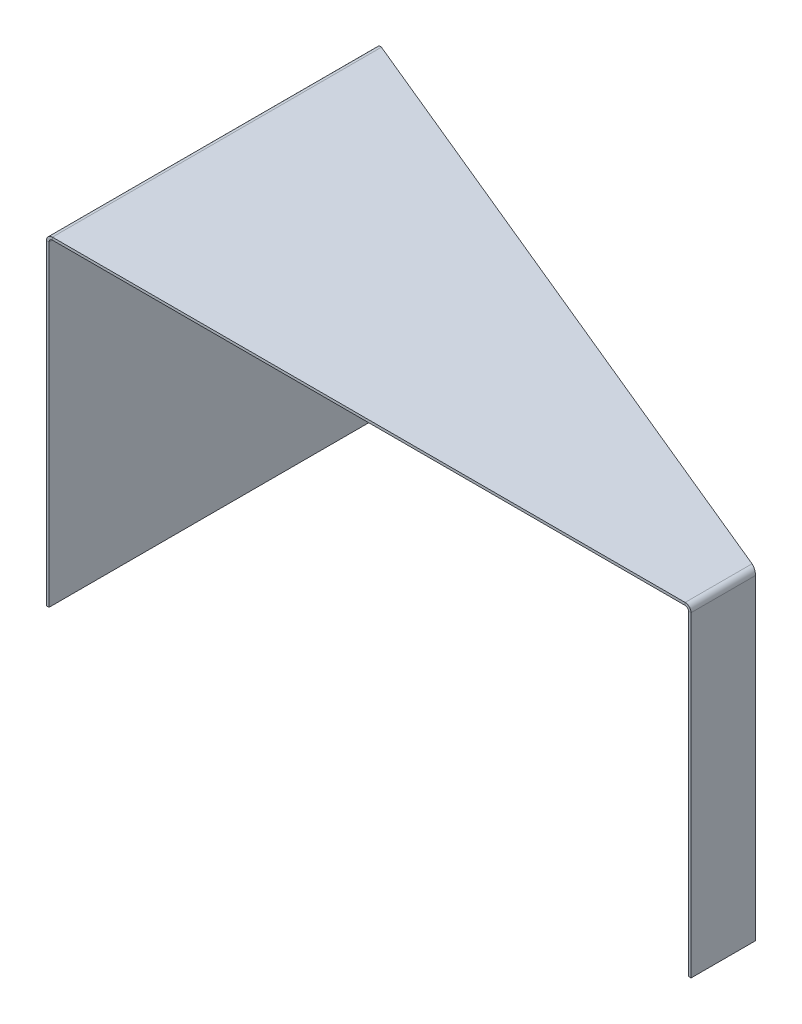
ISO-10303-21;
HEADER;
FILE_DESCRIPTION(('STEP AP214'),'2;1');
FILE_NAME('part.step','',(''),(''),'','','');
FILE_SCHEMA(('AUTOMOTIVE_DESIGN { 1 0 10303 214 1 1 1 1 }'));
ENDSEC;
DATA;
#1=APPLICATION_CONTEXT('core data for automotive mechanical design processes');
#2=APPLICATION_PROTOCOL_DEFINITION('international standard','automotive_design',2000,#1);
#3=PRODUCT_CONTEXT('',#1,'mechanical');
#4=PRODUCT('Part','Part','',(#3));
#5=PRODUCT_RELATED_PRODUCT_CATEGORY('part','',(#4));
#6=PRODUCT_DEFINITION_FORMATION('','',#4);
#7=PRODUCT_DEFINITION_CONTEXT('part definition',#1,'design');
#8=PRODUCT_DEFINITION('design','',#6,#7);
#9=PRODUCT_DEFINITION_SHAPE('','',#8);
#10=(LENGTH_UNIT() NAMED_UNIT(*) SI_UNIT(.MILLI.,.METRE.));
#11=(NAMED_UNIT(*) PLANE_ANGLE_UNIT() SI_UNIT($,.RADIAN.));
#12=(NAMED_UNIT(*) SI_UNIT($,.STERADIAN.) SOLID_ANGLE_UNIT());
#13=UNCERTAINTY_MEASURE_WITH_UNIT(LENGTH_MEASURE(1.E-05),#10,'distance_accuracy_value','');
#14=(GEOMETRIC_REPRESENTATION_CONTEXT(3) GLOBAL_UNCERTAINTY_ASSIGNED_CONTEXT((#13)) GLOBAL_UNIT_ASSIGNED_CONTEXT((#10,
#11,#12)) REPRESENTATION_CONTEXT('',''));
#15=CARTESIAN_POINT('',(0.,0.,0.));
#16=DIRECTION('',(0.,0.,1.));
#17=DIRECTION('',(1.,0.,0.));
#18=AXIS2_PLACEMENT_3D('',#15,#16,#17);
#19=CARTESIAN_POINT('',(498.,250.,300.));
#20=DIRECTION('',(1.,0.,0.));
#21=DIRECTION('',(0.,1.,0.));
#22=AXIS2_PLACEMENT_3D('',#19,#20,#21);
#23=PLANE('',#22);
#24=DIRECTION('',(0.,1.,0.));
#25=VECTOR('',#24,1.);
#26=CARTESIAN_POINT('',(498.,250.,250.));
#27=LINE('',#26,#25);
#28=CARTESIAN_POINT('',(498.,245.4,250.));
#29=VERTEX_POINT('',#28);
#30=CARTESIAN_POINT('',(498.,0.,250.));
#31=VERTEX_POINT('',#30);
#32=EDGE_CURVE('E259',#29,#31,#27,.F.);
#33=ORIENTED_EDGE('',*,*,#32,.T.);
#34=DIRECTION('',(0.,0.,-1.));
#35=VECTOR('',#34,1.);
#36=CARTESIAN_POINT('',(498.,0.,300.));
#37=LINE('',#36,#35);
#38=CARTESIAN_POINT('',(498.,0.,300.));
#39=VERTEX_POINT('',#38);
#40=EDGE_CURVE('E186',#39,#31,#37,.T.);
#41=ORIENTED_EDGE('',*,*,#40,.F.);
#42=DIRECTION('',(0.,-1.,0.));
#43=VECTOR('',#42,1.);
#44=CARTESIAN_POINT('',(498.,250.,300.));
#45=LINE('',#44,#43);
#46=CARTESIAN_POINT('',(498.,245.4,300.));
#47=VERTEX_POINT('',#46);
#48=EDGE_CURVE('E141',#47,#39,#45,.T.);
#49=ORIENTED_EDGE('',*,*,#48,.F.);
#50=DIRECTION('',(0.,0.,-1.));
#51=VECTOR('',#50,1.);
#52=CARTESIAN_POINT('',(498.,245.4,300.));
#53=LINE('',#52,#51);
#54=EDGE_CURVE('E156',#47,#29,#53,.T.);
#55=ORIENTED_EDGE('',*,*,#54,.T.);
#56=EDGE_LOOP('',(#33,#41,#49,#55));
#57=FACE_BOUND('',#56,.T.);
#58=ADVANCED_FACE('F34',(#57),#23,.F.);
#59=CARTESIAN_POINT('',(500.,0.,300.));
#60=DIRECTION('',(0.,-1.,0.));
#61=DIRECTION('',(1.,0.,0.));
#62=AXIS2_PLACEMENT_3D('',#59,#60,#61);
#63=PLANE('',#62);
#64=ORIENTED_EDGE('',*,*,#40,.T.);
#65=DIRECTION('',(1.,0.,0.));
#66=VECTOR('',#65,1.);
#67=CARTESIAN_POINT('',(500.,0.,250.));
#68=LINE('',#67,#66);
#69=CARTESIAN_POINT('',(500.,0.,250.));
#70=VERTEX_POINT('',#69);
#71=EDGE_CURVE('E262',#70,#31,#68,.F.);
#72=ORIENTED_EDGE('',*,*,#71,.F.);
#73=DIRECTION('',(0.,0.,-1.));
#74=VECTOR('',#73,1.);
#75=CARTESIAN_POINT('',(500.,0.,300.));
#76=LINE('',#75,#74);
#77=CARTESIAN_POINT('',(500.,0.,300.));
#78=VERTEX_POINT('',#77);
#79=EDGE_CURVE('E183',#78,#70,#76,.T.);
#80=ORIENTED_EDGE('',*,*,#79,.F.);
#81=DIRECTION('',(-1.,0.,0.));
#82=VECTOR('',#81,1.);
#83=CARTESIAN_POINT('',(500.,0.,300.));
#84=LINE('',#83,#82);
#85=EDGE_CURVE('E238',#78,#39,#84,.T.);
#86=ORIENTED_EDGE('',*,*,#85,.T.);
#87=EDGE_LOOP('',(#64,#72,#80,#86));
#88=FACE_BOUND('',#87,.T.);
#89=ADVANCED_FACE('F305',(#88),#63,.T.);
#90=CARTESIAN_POINT('',(500.,250.,300.));
#91=DIRECTION('',(1.,0.,0.));
#92=DIRECTION('',(0.,1.,0.));
#93=AXIS2_PLACEMENT_3D('',#90,#91,#92);
#94=PLANE('',#93);
#95=ORIENTED_EDGE('',*,*,#79,.T.);
#96=DIRECTION('',(0.,-1.,0.));
#97=VECTOR('',#96,1.);
#98=CARTESIAN_POINT('',(500.,1043.03609627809,250.));
#99=LINE('',#98,#97);
#100=CARTESIAN_POINT('',(500.,245.4,250.));
#101=VERTEX_POINT('',#100);
#102=EDGE_CURVE('E130',#101,#70,#99,.T.);
#103=ORIENTED_EDGE('',*,*,#102,.F.);
#104=DIRECTION('',(0.,0.,-1.));
#105=VECTOR('',#104,1.);
#106=CARTESIAN_POINT('',(500.,245.4,300.));
#107=LINE('',#106,#105);
#108=CARTESIAN_POINT('',(500.,245.4,300.));
#109=VERTEX_POINT('',#108);
#110=EDGE_CURVE('E180',#109,#101,#107,.T.);
#111=ORIENTED_EDGE('',*,*,#110,.F.);
#112=DIRECTION('',(0.,-1.,0.));
#113=VECTOR('',#112,1.);
#114=CARTESIAN_POINT('',(500.,250.,300.));
#115=LINE('',#114,#113);
#116=EDGE_CURVE('E240',#109,#78,#115,.T.);
#117=ORIENTED_EDGE('',*,*,#116,.T.);
#118=EDGE_LOOP('',(#95,#103,#111,#117));
#119=FACE_BOUND('',#118,.T.);
#120=ADVANCED_FACE('F310',(#119),#94,.T.);
#121=CARTESIAN_POINT('',(495.4,245.4,300.));
#122=DIRECTION('',(0.,0.,-1.));
#123=DIRECTION('',(-1.,0.,0.));
#124=AXIS2_PLACEMENT_3D('',#121,#122,#123);
#125=CYLINDRICAL_SURFACE('',#124,4.6);
#126=ORIENTED_EDGE('',*,*,#110,.T.);
#127=CARTESIAN_POINT('',(495.4,245.4,248.094617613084));
#128=DIRECTION('',(-0.382683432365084,0.,0.923879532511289));
#129=DIRECTION('',(-0.923879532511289,0.,-0.382683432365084));
#130=AXIS2_PLACEMENT_3D('',#127,#128,#129);
#131=ELLIPSE('',#130,4.979004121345,4.6);
#132=CARTESIAN_POINT('',(495.4,250.,248.094617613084));
#133=VERTEX_POINT('',#132);
#134=EDGE_CURVE('E131',#133,#101,#131,.F.);
#135=ORIENTED_EDGE('',*,*,#134,.F.);
#136=DIRECTION('',(0.,0.,-1.));
#137=VECTOR('',#136,1.);
#138=CARTESIAN_POINT('',(495.4,250.,300.));
#139=LINE('',#138,#137);
#140=CARTESIAN_POINT('',(495.4,250.,300.));
#141=VERTEX_POINT('',#140);
#142=EDGE_CURVE('E177',#141,#133,#139,.T.);
#143=ORIENTED_EDGE('',*,*,#142,.F.);
#144=CARTESIAN_POINT('',(495.4,245.4,300.));
#145=DIRECTION('',(0.,0.,1.));
#146=DIRECTION('',(1.,0.,0.));
#147=AXIS2_PLACEMENT_3D('',#144,#145,#146);
#148=CIRCLE('',#147,4.6);
#149=EDGE_CURVE('E246',#141,#109,#148,.F.);
#150=ORIENTED_EDGE('',*,*,#149,.T.);
#151=EDGE_LOOP('',(#126,#135,#143,#150));
#152=FACE_BOUND('',#151,.T.);
#153=ADVANCED_FACE('F256',(#152),#125,.T.);
#154=CARTESIAN_POINT('',(0.,250.,300.));
#155=DIRECTION('',(0.,1.,0.));
#156=DIRECTION('',(0.,0.,1.));
#157=AXIS2_PLACEMENT_3D('',#154,#155,#156);
#158=PLANE('',#157);
#159=ORIENTED_EDGE('',*,*,#142,.T.);
#160=DIRECTION('',(0.923879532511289,0.,0.382683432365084));
#161=VECTOR('',#160,1.);
#162=CARTESIAN_POINT('',(90.9009742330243,250.,80.5456351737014));
#163=LINE('',#162,#161);
#164=CARTESIAN_POINT('',(4.6,250.,44.7986012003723));
#165=VERTEX_POINT('',#164);
#166=EDGE_CURVE('E140',#165,#133,#163,.T.);
#167=ORIENTED_EDGE('',*,*,#166,.F.);
#168=DIRECTION('',(0.,0.,-1.));
#169=VECTOR('',#168,1.);
#170=CARTESIAN_POINT('',(4.6,250.,300.));
#171=LINE('',#170,#169);
#172=CARTESIAN_POINT('',(4.6,250.,300.));
#173=VERTEX_POINT('',#172);
#174=EDGE_CURVE('E174',#173,#165,#171,.T.);
#175=ORIENTED_EDGE('',*,*,#174,.F.);
#176=DIRECTION('',(1.,0.,0.));
#177=VECTOR('',#176,1.);
#178=CARTESIAN_POINT('',(0.,250.,300.));
#179=LINE('',#178,#177);
#180=EDGE_CURVE('E215',#173,#141,#179,.T.);
#181=ORIENTED_EDGE('',*,*,#180,.T.);
#182=EDGE_LOOP('',(#159,#167,#175,#181));
#183=FACE_BOUND('',#182,.T.);
#184=ADVANCED_FACE('F251',(#183),#158,.T.);
#185=CARTESIAN_POINT('',(4.6,245.4,300.));
#186=DIRECTION('',(0.,0.,-1.));
#187=DIRECTION('',(-1.,0.,0.));
#188=AXIS2_PLACEMENT_3D('',#185,#186,#187);
#189=CYLINDRICAL_SURFACE('',#188,4.6);
#190=ORIENTED_EDGE('',*,*,#174,.T.);
#191=CARTESIAN_POINT('',(4.6,245.4,44.7986012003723));
#192=DIRECTION('',(-0.227956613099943,0.,0.973671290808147));
#193=DIRECTION('',(-0.973671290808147,0.,-0.227956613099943));
#194=AXIS2_PLACEMENT_3D('',#191,#192,#193);
#195=ELLIPSE('',#194,4.72438701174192,4.6);
#196=CARTESIAN_POINT('',(0.,245.4,43.7216459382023));
#197=VERTEX_POINT('',#196);
#198=EDGE_CURVE('E211',#197,#165,#195,.F.);
#199=ORIENTED_EDGE('',*,*,#198,.F.);
#200=DIRECTION('',(0.,0.,-1.));
#201=VECTOR('',#200,1.);
#202=CARTESIAN_POINT('',(0.,245.4,300.));
#203=LINE('',#202,#201);
#204=CARTESIAN_POINT('',(0.,245.4,300.));
#205=VERTEX_POINT('',#204);
#206=EDGE_CURVE('E171',#205,#197,#203,.T.);
#207=ORIENTED_EDGE('',*,*,#206,.F.);
#208=CARTESIAN_POINT('',(4.6,245.4,300.));
#209=DIRECTION('',(0.,0.,1.));
#210=DIRECTION('',(1.,0.,0.));
#211=AXIS2_PLACEMENT_3D('',#208,#209,#210);
#212=CIRCLE('',#211,4.6);
#213=EDGE_CURVE('E210',#205,#173,#212,.F.);
#214=ORIENTED_EDGE('',*,*,#213,.T.);
#215=EDGE_LOOP('',(#190,#199,#207,#214));
#216=FACE_BOUND('',#215,.T.);
#217=ADVANCED_FACE('F209',(#216),#189,.T.);
#218=CARTESIAN_POINT('',(0.,0.,300.));
#219=DIRECTION('',(-1.,0.,0.));
#220=DIRECTION('',(0.,0.,1.));
#221=AXIS2_PLACEMENT_3D('',#218,#219,#220);
#222=PLANE('',#221);
#223=ORIENTED_EDGE('',*,*,#206,.T.);
#224=DIRECTION('',(0.,1.,0.));
#225=VECTOR('',#224,1.);
#226=CARTESIAN_POINT('',(0.,0.,43.7216459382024));
#227=LINE('',#226,#225);
#228=CARTESIAN_POINT('',(0.,0.,43.7216459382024));
#229=VERTEX_POINT('',#228);
#230=EDGE_CURVE('E270',#229,#197,#227,.T.);
#231=ORIENTED_EDGE('',*,*,#230,.F.);
#232=DIRECTION('',(0.,0.,-1.));
#233=VECTOR('',#232,1.);
#234=CARTESIAN_POINT('',(0.,0.,300.));
#235=LINE('',#234,#233);
#236=CARTESIAN_POINT('',(0.,0.,300.));
#237=VERTEX_POINT('',#236);
#238=EDGE_CURVE('E168',#237,#229,#235,.T.);
#239=ORIENTED_EDGE('',*,*,#238,.F.);
#240=DIRECTION('',(0.,1.,0.));
#241=VECTOR('',#240,1.);
#242=CARTESIAN_POINT('',(0.,0.,300.));
#243=LINE('',#242,#241);
#244=EDGE_CURVE('E198',#237,#205,#243,.T.);
#245=ORIENTED_EDGE('',*,*,#244,.T.);
#246=EDGE_LOOP('',(#223,#231,#239,#245));
#247=FACE_BOUND('',#246,.T.);
#248=ADVANCED_FACE('F217',(#247),#222,.T.);
#249=CARTESIAN_POINT('',(2.,0.,300.));
#250=DIRECTION('',(0.,-1.,0.));
#251=DIRECTION('',(0.,0.,-1.));
#252=AXIS2_PLACEMENT_3D('',#249,#250,#251);
#253=PLANE('',#252);
#254=ORIENTED_EDGE('',*,*,#238,.T.);
#255=DIRECTION('',(1.,0.,0.));
#256=VECTOR('',#255,1.);
#257=CARTESIAN_POINT('',(2.,0.,43.7216459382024));
#258=LINE('',#257,#256);
#259=CARTESIAN_POINT('',(2.,0.,43.7216459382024));
#260=VERTEX_POINT('',#259);
#261=EDGE_CURVE('E272',#260,#229,#258,.F.);
#262=ORIENTED_EDGE('',*,*,#261,.F.);
#263=DIRECTION('',(0.,0.,-1.));
#264=VECTOR('',#263,1.);
#265=CARTESIAN_POINT('',(2.,0.,300.));
#266=LINE('',#265,#264);
#267=CARTESIAN_POINT('',(2.,0.,300.));
#268=VERTEX_POINT('',#267);
#269=EDGE_CURVE('E165',#268,#260,#266,.T.);
#270=ORIENTED_EDGE('',*,*,#269,.F.);
#271=DIRECTION('',(-1.,0.,0.));
#272=VECTOR('',#271,1.);
#273=CARTESIAN_POINT('',(2.,0.,300.));
#274=LINE('',#273,#272);
#275=EDGE_CURVE('E218',#268,#237,#274,.T.);
#276=ORIENTED_EDGE('',*,*,#275,.T.);
#277=EDGE_LOOP('',(#254,#262,#270,#276));
#278=FACE_BOUND('',#277,.T.);
#279=ADVANCED_FACE('F284',(#278),#253,.T.);
#280=CARTESIAN_POINT('',(2.,0.,300.));
#281=DIRECTION('',(-1.,0.,0.));
#282=DIRECTION('',(0.,0.,1.));
#283=AXIS2_PLACEMENT_3D('',#280,#281,#282);
#284=PLANE('',#283);
#285=DIRECTION('',(0.,1.,0.));
#286=VECTOR('',#285,1.);
#287=CARTESIAN_POINT('',(2.,0.,43.7216459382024));
#288=LINE('',#287,#286);
#289=CARTESIAN_POINT('',(2.,245.4,43.7216459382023));
#290=VERTEX_POINT('',#289);
#291=EDGE_CURVE('E267',#260,#290,#288,.T.);
#292=ORIENTED_EDGE('',*,*,#291,.T.);
#293=DIRECTION('',(0.,0.,-1.));
#294=VECTOR('',#293,1.);
#295=CARTESIAN_POINT('',(2.,245.4,300.));
#296=LINE('',#295,#294);
#297=CARTESIAN_POINT('',(2.,245.4,300.));
#298=VERTEX_POINT('',#297);
#299=EDGE_CURVE('E158',#298,#290,#296,.T.);
#300=ORIENTED_EDGE('',*,*,#299,.F.);
#301=DIRECTION('',(0.,1.,0.));
#302=VECTOR('',#301,1.);
#303=CARTESIAN_POINT('',(2.,0.,300.));
#304=LINE('',#303,#302);
#305=EDGE_CURVE('E201',#268,#298,#304,.T.);
#306=ORIENTED_EDGE('',*,*,#305,.F.);
#307=ORIENTED_EDGE('',*,*,#269,.T.);
#308=EDGE_LOOP('',(#292,#300,#306,#307));
#309=FACE_BOUND('',#308,.T.);
#310=ADVANCED_FACE('F286',(#309),#284,.F.);
#311=CARTESIAN_POINT('',(4.6,245.4,300.));
#312=DIRECTION('',(0.,0.,-1.));
#313=DIRECTION('',(-1.,0.,0.));
#314=AXIS2_PLACEMENT_3D('',#311,#312,#313);
#315=CYLINDRICAL_SURFACE('',#314,2.6);
#316=CARTESIAN_POINT('',(4.6,245.4,44.7986012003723));
#317=DIRECTION('',(-0.382683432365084,0.,0.923879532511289));
#318=DIRECTION('',(-0.923879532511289,0.,-0.382683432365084));
#319=AXIS2_PLACEMENT_3D('',#316,#317,#318);
#320=ELLIPSE('',#319,2.81421972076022,2.6);
#321=CARTESIAN_POINT('',(4.6,248.,44.7986012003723));
#322=VERTEX_POINT('',#321);
#323=EDGE_CURVE('E264',#290,#322,#320,.F.);
#324=ORIENTED_EDGE('',*,*,#323,.T.);
#325=DIRECTION('',(0.,0.,-1.));
#326=VECTOR('',#325,1.);
#327=CARTESIAN_POINT('',(4.6,248.,300.));
#328=LINE('',#327,#326);
#329=CARTESIAN_POINT('',(4.6,248.,300.));
#330=VERTEX_POINT('',#329);
#331=EDGE_CURVE('E152',#330,#322,#328,.T.);
#332=ORIENTED_EDGE('',*,*,#331,.F.);
#333=CARTESIAN_POINT('',(4.6,245.4,300.));
#334=DIRECTION('',(0.,0.,1.));
#335=DIRECTION('',(1.,0.,0.));
#336=AXIS2_PLACEMENT_3D('',#333,#334,#335);
#337=CIRCLE('',#336,2.6);
#338=EDGE_CURVE('E224',#298,#330,#337,.F.);
#339=ORIENTED_EDGE('',*,*,#338,.F.);
#340=ORIENTED_EDGE('',*,*,#299,.T.);
#341=EDGE_LOOP('',(#324,#332,#339,#340));
#342=FACE_BOUND('',#341,.T.);
#343=ADVANCED_FACE('F289',(#342),#315,.F.);
#344=CARTESIAN_POINT('',(0.,248.,300.));
#345=DIRECTION('',(0.,1.,0.));
#346=DIRECTION('',(0.,0.,1.));
#347=AXIS2_PLACEMENT_3D('',#344,#345,#346);
#348=PLANE('',#347);
#349=DIRECTION('',(0.923879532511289,0.,0.382683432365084));
#350=VECTOR('',#349,1.);
#351=CARTESIAN_POINT('',(90.9009742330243,248.,80.5456351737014));
#352=LINE('',#351,#350);
#353=CARTESIAN_POINT('',(495.4,248.,248.094617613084));
#354=VERTEX_POINT('',#353);
#355=EDGE_CURVE('E137',#322,#354,#352,.T.);
#356=ORIENTED_EDGE('',*,*,#355,.T.);
#357=DIRECTION('',(0.,0.,-1.));
#358=VECTOR('',#357,1.);
#359=CARTESIAN_POINT('',(495.4,248.,300.));
#360=LINE('',#359,#358);
#361=CARTESIAN_POINT('',(495.4,248.,300.));
#362=VERTEX_POINT('',#361);
#363=EDGE_CURVE('E149',#362,#354,#360,.T.);
#364=ORIENTED_EDGE('',*,*,#363,.F.);
#365=DIRECTION('',(1.,0.,0.));
#366=VECTOR('',#365,1.);
#367=CARTESIAN_POINT('',(0.,248.,300.));
#368=LINE('',#367,#366);
#369=EDGE_CURVE('E226',#330,#362,#368,.T.);
#370=ORIENTED_EDGE('',*,*,#369,.F.);
#371=ORIENTED_EDGE('',*,*,#331,.T.);
#372=EDGE_LOOP('',(#356,#364,#370,#371));
#373=FACE_BOUND('',#372,.T.);
#374=ADVANCED_FACE('F147',(#373),#348,.F.);
#375=CARTESIAN_POINT('',(495.4,245.4,300.));
#376=DIRECTION('',(0.,0.,-1.));
#377=DIRECTION('',(-1.,0.,0.));
#378=AXIS2_PLACEMENT_3D('',#375,#376,#377);
#379=CYLINDRICAL_SURFACE('',#378,2.6);
#380=CARTESIAN_POINT('',(495.4,245.4,248.094617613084));
#381=DIRECTION('',(-0.59110454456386,0.,0.806594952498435));
#382=DIRECTION('',(-0.806594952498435,0.,-0.59110454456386));
#383=AXIS2_PLACEMENT_3D('',#380,#381,#382);
#384=ELLIPSE('',#383,3.22342706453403,2.6);
#385=EDGE_CURVE('E121',#354,#29,#384,.F.);
#386=ORIENTED_EDGE('',*,*,#385,.T.);
#387=ORIENTED_EDGE('',*,*,#54,.F.);
#388=CARTESIAN_POINT('',(495.4,245.4,300.));
#389=DIRECTION('',(0.,0.,1.));
#390=DIRECTION('',(1.,0.,0.));
#391=AXIS2_PLACEMENT_3D('',#388,#389,#390);
#392=CIRCLE('',#391,2.6);
#393=EDGE_CURVE('E155',#362,#47,#392,.F.);
#394=ORIENTED_EDGE('',*,*,#393,.F.);
#395=ORIENTED_EDGE('',*,*,#363,.T.);
#396=EDGE_LOOP('',(#386,#387,#394,#395));
#397=FACE_BOUND('',#396,.T.);
#398=ADVANCED_FACE('F154',(#397),#379,.F.);
#399=CARTESIAN_POINT('',(4.6,250.,300.));
#400=DIRECTION('',(0.,0.,1.));
#401=DIRECTION('',(1.,0.,0.));
#402=AXIS2_PLACEMENT_3D('',#399,#400,#401);
#403=PLANE('',#402);
#404=DIRECTION('',(0.,-1.,0.));
#405=VECTOR('',#404,1.);
#406=CARTESIAN_POINT('',(4.6,250.,300.));
#407=LINE('',#406,#405);
#408=EDGE_CURVE('E11',#173,#330,#407,.T.);
#409=ORIENTED_EDGE('',*,*,#408,.F.);
#410=ORIENTED_EDGE('',*,*,#213,.F.);
#411=DIRECTION('',(-1.,0.,0.));
#412=VECTOR('',#411,1.);
#413=CARTESIAN_POINT('',(2.,245.4,300.));
#414=LINE('',#413,#412);
#415=EDGE_CURVE('E42',#298,#205,#414,.T.);
#416=ORIENTED_EDGE('',*,*,#415,.F.);
#417=ORIENTED_EDGE('',*,*,#338,.T.);
#418=EDGE_LOOP('',(#409,#410,#416,#417));
#419=FACE_BOUND('',#418,.T.);
#420=ADVANCED_FACE('F36',(#419),#403,.T.);
#421=CARTESIAN_POINT('',(2.,245.4,300.));
#422=DIRECTION('',(0.,0.,1.));
#423=DIRECTION('',(1.,0.,0.));
#424=AXIS2_PLACEMENT_3D('',#421,#422,#423);
#425=PLANE('',#424);
#426=ORIENTED_EDGE('',*,*,#180,.F.);
#427=ORIENTED_EDGE('',*,*,#408,.T.);
#428=ORIENTED_EDGE('',*,*,#369,.T.);
#429=DIRECTION('',(0.,1.,0.));
#430=VECTOR('',#429,1.);
#431=CARTESIAN_POINT('',(495.4,248.,300.));
#432=LINE('',#431,#430);
#433=EDGE_CURVE('E189',#362,#141,#432,.T.);
#434=ORIENTED_EDGE('',*,*,#433,.T.);
#435=EDGE_LOOP('',(#426,#427,#428,#434));
#436=FACE_BOUND('',#435,.T.);
#437=ADVANCED_FACE('F254',(#436),#425,.T.);
#438=CARTESIAN_POINT('',(500.,245.4,300.));
#439=DIRECTION('',(0.,0.,1.));
#440=DIRECTION('',(1.,0.,0.));
#441=AXIS2_PLACEMENT_3D('',#438,#439,#440);
#442=PLANE('',#441);
#443=DIRECTION('',(-1.,0.,0.));
#444=VECTOR('',#443,1.);
#445=CARTESIAN_POINT('',(500.,245.4,300.));
#446=LINE('',#445,#444);
#447=EDGE_CURVE('E57',#109,#47,#446,.T.);
#448=ORIENTED_EDGE('',*,*,#447,.F.);
#449=ORIENTED_EDGE('',*,*,#149,.F.);
#450=ORIENTED_EDGE('',*,*,#433,.F.);
#451=ORIENTED_EDGE('',*,*,#393,.T.);
#452=EDGE_LOOP('',(#448,#449,#450,#451));
#453=FACE_BOUND('',#452,.T.);
#454=ADVANCED_FACE('F229',(#453),#442,.T.);
#455=CARTESIAN_POINT('',(495.4,248.,300.));
#456=DIRECTION('',(0.,0.,1.));
#457=DIRECTION('',(1.,0.,0.));
#458=AXIS2_PLACEMENT_3D('',#455,#456,#457);
#459=PLANE('',#458);
#460=ORIENTED_EDGE('',*,*,#116,.F.);
#461=ORIENTED_EDGE('',*,*,#447,.T.);
#462=ORIENTED_EDGE('',*,*,#48,.T.);
#463=ORIENTED_EDGE('',*,*,#85,.F.);
#464=EDGE_LOOP('',(#460,#461,#462,#463));
#465=FACE_BOUND('',#464,.T.);
#466=ADVANCED_FACE('F315',(#465),#459,.T.);
#467=CARTESIAN_POINT('',(495.4,245.4,300.));
#468=DIRECTION('',(0.,0.,1.));
#469=DIRECTION('',(1.,0.,0.));
#470=AXIS2_PLACEMENT_3D('',#467,#468,#469);
#471=PLANE('',#470);
#472=ORIENTED_EDGE('',*,*,#305,.T.);
#473=ORIENTED_EDGE('',*,*,#415,.T.);
#474=ORIENTED_EDGE('',*,*,#244,.F.);
#475=ORIENTED_EDGE('',*,*,#275,.F.);
#476=EDGE_LOOP('',(#472,#473,#474,#475));
#477=FACE_BOUND('',#476,.T.);
#478=ADVANCED_FACE('F195',(#477),#471,.T.);
#479=CARTESIAN_POINT('',(90.9009742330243,250.,80.5456351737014));
#480=DIRECTION('',(-0.382683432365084,0.,0.923879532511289));
#481=DIRECTION('',(0.923879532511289,0.,0.382683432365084));
#482=AXIS2_PLACEMENT_3D('',#479,#480,#481);
#483=PLANE('',#482);
#484=ORIENTED_EDGE('',*,*,#166,.T.);
#485=DIRECTION('',(0.,1.,0.));
#486=VECTOR('',#485,1.);
#487=CARTESIAN_POINT('',(495.4,250.,248.094617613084));
#488=LINE('',#487,#486);
#489=EDGE_CURVE('E124',#133,#354,#488,.F.);
#490=ORIENTED_EDGE('',*,*,#489,.T.);
#491=ORIENTED_EDGE('',*,*,#355,.F.);
#492=DIRECTION('',(0.,1.,0.));
#493=VECTOR('',#492,1.);
#494=CARTESIAN_POINT('',(4.6,250.,44.7986012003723));
#495=LINE('',#494,#493);
#496=EDGE_CURVE('E142',#165,#322,#495,.F.);
#497=ORIENTED_EDGE('',*,*,#496,.F.);
#498=EDGE_LOOP('',(#484,#490,#491,#497));
#499=FACE_BOUND('',#498,.T.);
#500=ADVANCED_FACE('F135',(#499),#483,.F.);
#501=CARTESIAN_POINT('',(2.,0.,43.7216459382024));
#502=DIRECTION('',(0.,0.,1.));
#503=DIRECTION('',(0.,1.,0.));
#504=AXIS2_PLACEMENT_3D('',#501,#502,#503);
#505=PLANE('',#504);
#506=DIRECTION('',(1.,0.,0.));
#507=VECTOR('',#506,1.);
#508=CARTESIAN_POINT('',(2.,245.4,43.7216459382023));
#509=LINE('',#508,#507);
#510=EDGE_CURVE('E275',#290,#197,#509,.F.);
#511=ORIENTED_EDGE('',*,*,#510,.F.);
#512=ORIENTED_EDGE('',*,*,#291,.F.);
#513=ORIENTED_EDGE('',*,*,#261,.T.);
#514=ORIENTED_EDGE('',*,*,#230,.T.);
#515=EDGE_LOOP('',(#511,#512,#513,#514));
#516=FACE_BOUND('',#515,.T.);
#517=ADVANCED_FACE('F282',(#516),#505,.F.);
#518=CARTESIAN_POINT('',(0.,245.4,43.7216459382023));
#519=CARTESIAN_POINT('',(0.666666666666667,245.4,43.7216459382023));
#520=CARTESIAN_POINT('',(1.33333333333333,245.4,43.7216459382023));
#521=CARTESIAN_POINT('',(2.,245.4,43.7216459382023));
#522=CARTESIAN_POINT('',(0.,254.6,43.7216459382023));
#523=CARTESIAN_POINT('',(0.666666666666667,253.266666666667,43.7216459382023));
#524=CARTESIAN_POINT('',(1.33333333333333,251.933333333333,43.7216459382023));
#525=CARTESIAN_POINT('',(2.,250.6,43.7216459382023));
#526=CARTESIAN_POINT('',(9.2,254.6,45.8755564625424));
#527=CARTESIAN_POINT('',(8.53333333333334,253.266666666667,45.8755564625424));
#528=CARTESIAN_POINT('',(7.86666666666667,251.933333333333,45.8755564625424));
#529=CARTESIAN_POINT('',(7.2,250.6,45.8755564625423));
#530=CARTESIAN_POINT('',(9.2,245.4,45.8755564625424));
#531=CARTESIAN_POINT('',(8.53333333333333,245.4,45.8755564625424));
#532=CARTESIAN_POINT('',(7.86666666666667,245.4,45.8755564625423));
#533=CARTESIAN_POINT('',(7.2,245.4,45.8755564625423));
#534=CARTESIAN_POINT('',(9.2,236.2,45.8755564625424));
#535=CARTESIAN_POINT('',(8.53333333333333,237.533333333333,45.8755564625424));
#536=CARTESIAN_POINT('',(7.86666666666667,238.866666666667,45.8755564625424));
#537=CARTESIAN_POINT('',(7.2,240.2,45.8755564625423));
#538=CARTESIAN_POINT('',(0.,236.2,43.7216459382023));
#539=CARTESIAN_POINT('',(0.666666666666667,237.533333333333,43.7216459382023));
#540=CARTESIAN_POINT('',(1.33333333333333,238.866666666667,43.7216459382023));
#541=CARTESIAN_POINT('',(2.,240.2,43.7216459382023));
#542=CARTESIAN_POINT('',(0.,245.4,43.7216459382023));
#543=CARTESIAN_POINT('',(0.666666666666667,245.4,43.7216459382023));
#544=CARTESIAN_POINT('',(1.33333333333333,245.4,43.7216459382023));
#545=CARTESIAN_POINT('',(2.,245.4,43.7216459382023));
#546=(BOUNDED_SURFACE() B_SPLINE_SURFACE(3,3,((#518,#519,#520,#521),(#522,#523,#524,#525),(#526,
#527,#528,#529),(#530,#531,#532,#533),(#534,#535,#536,#537),(#538,#539,#540,#541),(#542,#543,
#544,#545)),.UNSPECIFIED.,.T.,.F.,.F.) B_SPLINE_SURFACE_WITH_KNOTS((4,3,4),(4,4),(0.,0.5,1.),
(0.,1.),.UNSPECIFIED.) GEOMETRIC_REPRESENTATION_ITEM() RATIONAL_B_SPLINE_SURFACE(((1.,1.,1.,1.),
(0.333333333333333,0.333333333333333,0.333333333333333,0.333333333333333),(0.333333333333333,
0.333333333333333,0.333333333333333,0.333333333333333),(1.,1.,1.,1.),(0.333333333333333,
0.333333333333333,0.333333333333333,0.333333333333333),(0.333333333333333,0.333333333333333,
0.333333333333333,0.333333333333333),(1.,1.,1.,1.))) REPRESENTATION_ITEM('') SURFACE());
#547=ORIENTED_EDGE('',*,*,#496,.T.);
#548=ORIENTED_EDGE('',*,*,#323,.F.);
#549=ORIENTED_EDGE('',*,*,#510,.T.);
#550=ORIENTED_EDGE('',*,*,#198,.T.);
#551=EDGE_LOOP('',(#547,#548,#549,#550));
#552=FACE_BOUND('',#551,.T.);
#553=ADVANCED_FACE('F291',(#552),#546,.T.);
#554=CARTESIAN_POINT('',(500.,1043.03609627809,250.));
#555=DIRECTION('',(0.,0.,1.));
#556=DIRECTION('',(0.,-1.,0.));
#557=AXIS2_PLACEMENT_3D('',#554,#555,#556);
#558=PLANE('',#557);
#559=ORIENTED_EDGE('',*,*,#102,.T.);
#560=ORIENTED_EDGE('',*,*,#71,.T.);
#561=ORIENTED_EDGE('',*,*,#32,.F.);
#562=DIRECTION('',(1.,0.,0.));
#563=VECTOR('',#562,1.);
#564=CARTESIAN_POINT('',(500.,245.4,250.));
#565=LINE('',#564,#563);
#566=EDGE_CURVE('E49',#101,#29,#565,.F.);
#567=ORIENTED_EDGE('',*,*,#566,.F.);
#568=EDGE_LOOP('',(#559,#560,#561,#567));
#569=FACE_BOUND('',#568,.T.);
#570=ADVANCED_FACE('F293',(#569),#558,.F.);
#571=CARTESIAN_POINT('',(490.8,245.4,246.189235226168));
#572=CARTESIAN_POINT('',(491.466666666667,245.4,246.189235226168));
#573=CARTESIAN_POINT('',(492.133333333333,245.4,246.189235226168));
#574=CARTESIAN_POINT('',(492.8,245.4,246.189235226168));
#575=CARTESIAN_POINT('',(490.8,254.6,246.189235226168));
#576=CARTESIAN_POINT('',(491.466666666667,253.266666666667,246.189235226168));
#577=CARTESIAN_POINT('',(492.133333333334,251.933333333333,246.189235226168));
#578=CARTESIAN_POINT('',(492.8,250.6,246.189235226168));
#579=CARTESIAN_POINT('',(500.,254.6,250.));
#580=CARTESIAN_POINT('',(499.333333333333,253.266666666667,250.));
#581=CARTESIAN_POINT('',(498.666666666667,251.933333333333,250.));
#582=CARTESIAN_POINT('',(498.,250.6,250.));
#583=CARTESIAN_POINT('',(500.,245.4,250.));
#584=CARTESIAN_POINT('',(499.333333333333,245.4,250.));
#585=CARTESIAN_POINT('',(498.666666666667,245.4,250.));
#586=CARTESIAN_POINT('',(498.,245.4,250.));
#587=CARTESIAN_POINT('',(500.,236.2,250.));
#588=CARTESIAN_POINT('',(499.333333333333,237.533333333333,250.));
#589=CARTESIAN_POINT('',(498.666666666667,238.866666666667,250.));
#590=CARTESIAN_POINT('',(498.,240.2,250.));
#591=CARTESIAN_POINT('',(490.8,236.2,246.189235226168));
#592=CARTESIAN_POINT('',(491.466666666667,237.533333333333,246.189235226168));
#593=CARTESIAN_POINT('',(492.133333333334,238.866666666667,246.189235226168));
#594=CARTESIAN_POINT('',(492.8,240.2,246.189235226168));
#595=CARTESIAN_POINT('',(490.8,245.4,246.189235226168));
#596=CARTESIAN_POINT('',(491.466666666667,245.4,246.189235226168));
#597=CARTESIAN_POINT('',(492.133333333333,245.4,246.189235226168));
#598=CARTESIAN_POINT('',(492.8,245.4,246.189235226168));
#599=(BOUNDED_SURFACE() B_SPLINE_SURFACE(3,3,((#571,#572,#573,#574),(#575,#576,#577,#578),(#579,
#580,#581,#582),(#583,#584,#585,#586),(#587,#588,#589,#590),(#591,#592,#593,#594),(#595,#596,
#597,#598)),.UNSPECIFIED.,.T.,.F.,.F.) B_SPLINE_SURFACE_WITH_KNOTS((4,3,4),(4,4),(0.,0.5,1.),
(0.,1.),.UNSPECIFIED.) GEOMETRIC_REPRESENTATION_ITEM() RATIONAL_B_SPLINE_SURFACE(((1.,1.,1.,1.),
(0.333333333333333,0.333333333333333,0.333333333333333,0.333333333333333),(0.333333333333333,
0.333333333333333,0.333333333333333,0.333333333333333),(1.,1.,1.,1.),(0.333333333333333,
0.333333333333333,0.333333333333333,0.333333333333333),(0.333333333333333,0.333333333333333,
0.333333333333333,0.333333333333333),(1.,1.,1.,1.))) REPRESENTATION_ITEM('') SURFACE());
#600=ORIENTED_EDGE('',*,*,#134,.T.);
#601=ORIENTED_EDGE('',*,*,#566,.T.);
#602=ORIENTED_EDGE('',*,*,#385,.F.);
#603=ORIENTED_EDGE('',*,*,#489,.F.);
#604=EDGE_LOOP('',(#600,#601,#602,#603));
#605=FACE_BOUND('',#604,.T.);
#606=ADVANCED_FACE('F123',(#605),#599,.T.);
#607=CLOSED_SHELL('',(#58,#89,#120,#153,#184,#217,#248,#279,#310,#343,#374,#398,#420,#437,#454,
#466,#478,#500,#517,#553,#570,#606));
#608=MANIFOLD_SOLID_BREP('B2',#607);
#609=ADVANCED_BREP_SHAPE_REPRESENTATION('',(#18,#608),#14);
#610=SHAPE_DEFINITION_REPRESENTATION(#9,#609);
ENDSEC;
END-ISO-10303-21;
